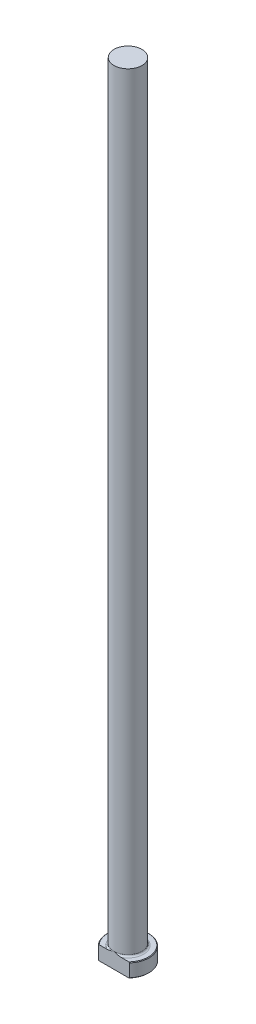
from build123d import *

# Parameters (mm, degrees)
CHAMFER1_SIZE = 0.254
FILLET1_R     = 0.762
KEY_DEPTH     = 356.855042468


with BuildPart() as part:
    # Sketch1 → Revolve1 (revolve)
    with BuildSketch(Plane.XY, mode=Mode.PRIVATE) as revolve1_sk:
        Polygon((0, 0), (-9.525, 0), (-9.525, 6.35), (-6.35, 6.35), (-6.35, 355.6), (0, 355.6), align=None)
    revolve(revolve1_sk.sketch.rotate(Axis((0, 259.958771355, 0), (0, -1, 0)), 270), axis=Axis((0, 259.958771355, 0), (0, -1, 0)))

    # Chamfer1
    chamfer1_edges = [part.edges().sort_by_distance(p)[0] for p in [
        (0, 6.35, -9.525),
        (0, 0, -9.525),
    ]]
    chamfer(chamfer1_edges, length=CHAMFER1_SIZE)

    # Fillet1
    fillet1_edges = [part.edges().sort_by_distance(p)[0] for p in [
        (0, 6.35, -6.35),
    ]]
    fillet(fillet1_edges, radius=FILLET1_R)

    # Sketch2 → KEY (cut, through all)
    with BuildSketch(Plane.XZ):
        with BuildLine():
            Line((-7.099515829, 6.35), (7.099515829, 6.35))
            ThreePointArc((7.099515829, 6.35), (0, 9.525), (-7.099515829, 6.35))
        make_face()
    extrude(amount=-KEY_DEPTH, mode=Mode.SUBTRACT)


solid = part.part
